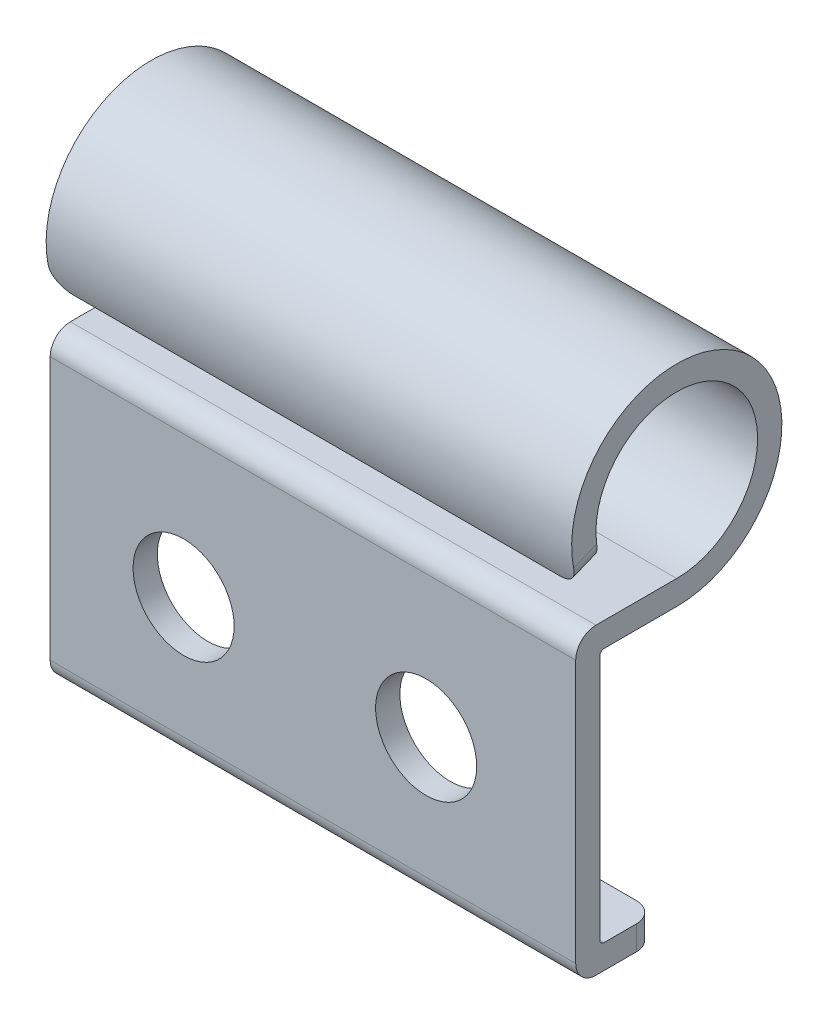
from build123d import *

# Parameters (mm, degrees)
EXTRUDE_THIN1_DEPTH = 13
CUT_EXTRUDE1_REACH  = 18.89
SKETCH2_R           = 1.25
FILLET1_R           = 0.5
FILLET2_R           = 0.1


with BuildPart() as part:
    # Sketch1 → Extrude-Thin1 (new body)
    with BuildSketch(Plane(origin=(0, 0, 0), x_dir=(0, 0, -1), z_dir=(1, 0, 0))):
        with BuildLine():
            Line((-0.5, -9.5), (-2, -9.5))
            ThreePointArc((-2, -9.5), (-2.353553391, -9.353553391), (-2.5, -9))
            Line((-2.5, -9), (-2.5, -2.5))
            ThreePointArc((-2.5, -2.5), (-2.353553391, -2.146446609), (-2, -2))
            Line((-2, -2), (0, -2))
            ThreePointArc((0, -2), (1.114391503, 1.660762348), (-1.85073945, -0.758131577))
            Line((-1.85073945, -0.758131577), (-2.405961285, -0.985571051))
            ThreePointArc((-2.405961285, -0.985571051), (1.448708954, 2.158991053), (0, -2.6))
            Line((0, -2.6), (-1.9, -2.6))
            Line((-1.9, -2.6), (-1.9, -8.9))
            Line((-1.9, -8.9), (-0.5, -8.9))
            Line((-0.5, -8.9), (-0.5, -9.5))
        make_face()
    extrude(amount=EXTRUDE_THIN1_DEPTH)

    # Sketch2 → Cut-Extrude1 (cut, up to next)
    with BuildSketch(Plane(origin=(0, 0, 2.5), x_dir=(-1, 0, 0), z_dir=(0, 0, -1)), mode=Mode.PRIVATE) as cut_extrude1_sk1:
        with Locations(Location((-3.3, -6, 0), (0, 0, 180))):
            Circle(SKETCH2_R)
    cut_extrude1_tool1 = extrude(cut_extrude1_sk1.sketch, amount=CUT_EXTRUDE1_REACH, mode=Mode.PRIVATE) & part.part
    # Sketch2 → Cut-Extrude1 (cut, up to next)
    with BuildSketch(Plane(origin=(0, 0, 2.5), x_dir=(-1, 0, 0), z_dir=(0, 0, -1)), mode=Mode.PRIVATE) as cut_extrude1_sk2:
        with Locations(Location((-9.3, -6, 0), (0, 0, 180))):
            Circle(SKETCH2_R)
    cut_extrude1_tool2 = extrude(cut_extrude1_sk2.sketch, amount=CUT_EXTRUDE1_REACH, mode=Mode.PRIVATE) & part.part
    add(cut_extrude1_tool1.solids().sort_by_distance((3.3, -6, 2.5))[0], mode=Mode.SUBTRACT)
    add(cut_extrude1_tool2.solids().sort_by_distance((9.3, -6, 2.5))[0], mode=Mode.SUBTRACT)

    # Fillet1
    fillet1_edges = [part.edges().sort_by_distance(p)[0] for p in [
        (0, -9.2, 0.5),
        (0, -0.871851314, 2.128350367),
        (13, -9.2, 0.5),
        (13, -0.871851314, 2.128350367),
    ]]
    fillet(fillet1_edges, radius=FILLET1_R)

    # Fillet2
    fillet2_edges = [part.edges().sort_by_distance(p)[0] for p in [
        (6.5, -2.6, 1.9),
        (6.5, -8.9, 1.9),
    ]]
    fillet(fillet2_edges, radius=FILLET2_R)


solid = part.part
